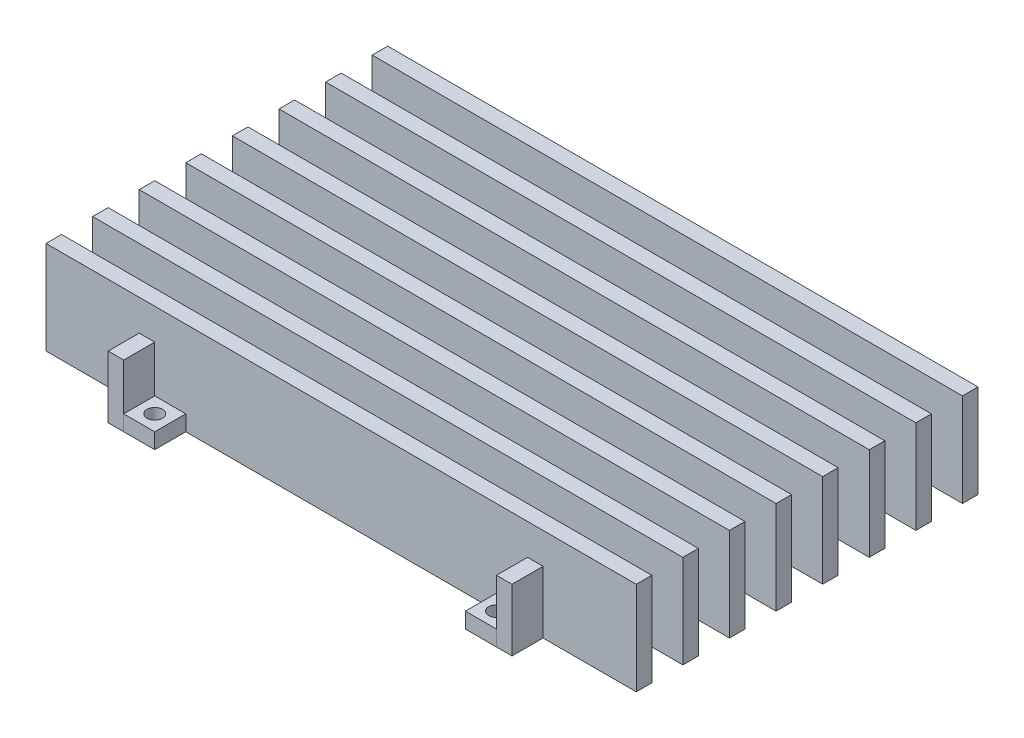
from build123d import *

# Parameters (mm, degrees)
SKETCH2_W             = 120.65
SKETCH2_H             = 3.175
BOSS_EXTRUDE1_DEPTH   = 9.525
BOSS_EXTRUDE1_2_DEPTH = 9.525
BOSS_EXTRUDE1_3_DEPTH = 9.525
BOSS_EXTRUDE1_4_DEPTH = 9.525
BOSS_EXTRUDE1_5_DEPTH = 9.525
BOSS_EXTRUDE1_6_DEPTH = 9.525
BOSS_EXTRUDE1_7_DEPTH = 9.525
BOSS_EXTRUDE1_8_DEPTH = 9.525
SKETCH3_W             = 3.175
SKETCH3_H             = 82.55
BOSS_EXTRUDE2_DEPTH   = 12.7
SKETCH4_W             = 6.35
SKETCH4_H             = 6.35
SKETCH4_R             = 1.5875
BOSS_EXTRUDE3_DEPTH   = 3.175
BOSS_EXTRUDE3_2_DEPTH = 3.175
BOSS_EXTRUDE3_3_DEPTH = 3.175
BOSS_EXTRUDE3_4_DEPTH = 3.175


with BuildPart() as part:
    # Sketch2 → Boss-Extrude1 (new, symmetric)
    with BuildSketch(Plane(origin=(0, 0, 0), x_dir=(1, 0, 0), z_dir=(0, 1, 0))):
        with Locations((0, -33.3375)):
            Rectangle(SKETCH2_W, SKETCH2_H)
    extrude(amount=BOSS_EXTRUDE1_DEPTH, both=True)



with BuildPart() as body_2:
    # Sketch2 → Boss-Extrude1 2 (new, symmetric)
    with BuildSketch(Plane(origin=(0, 0, 0), x_dir=(1, 0, 0), z_dir=(0, 1, 0))):
        with Locations((0, -23.8125)):
            Rectangle(SKETCH2_W, SKETCH2_H)
    extrude(amount=BOSS_EXTRUDE1_2_DEPTH, both=True)


with BuildPart() as body_3:
    # Sketch2 → Boss-Extrude1 3 (new, symmetric)
    with BuildSketch(Plane(origin=(0, 0, 0), x_dir=(1, 0, 0), z_dir=(0, 1, 0))):
        with Locations((0, -14.2875)):
            Rectangle(SKETCH2_W, SKETCH2_H)
    extrude(amount=BOSS_EXTRUDE1_3_DEPTH, both=True)


with BuildPart() as body_4:
    # Sketch2 → Boss-Extrude1 4 (new, symmetric)
    with BuildSketch(Plane(origin=(0, 0, 0), x_dir=(1, 0, 0), z_dir=(0, 1, 0))):
        with Locations((0, -4.7625)):
            Rectangle(SKETCH2_W, SKETCH2_H)
    extrude(amount=BOSS_EXTRUDE1_4_DEPTH, both=True)


with BuildPart() as body_5:
    # Sketch2 → Boss-Extrude1 5 (new, symmetric)
    with BuildSketch(Plane(origin=(0, 0, 0), x_dir=(1, 0, 0), z_dir=(0, 1, 0))):
        with Locations((0, 4.7625)):
            Rectangle(SKETCH2_W, SKETCH2_H)
    extrude(amount=BOSS_EXTRUDE1_5_DEPTH, both=True)


with BuildPart() as body_6:
    # Sketch2 → Boss-Extrude1 6 (new, symmetric)
    with BuildSketch(Plane(origin=(0, 0, 0), x_dir=(1, 0, 0), z_dir=(0, 1, 0))):
        with Locations((0, 14.2875)):
            Rectangle(SKETCH2_W, SKETCH2_H)
    extrude(amount=BOSS_EXTRUDE1_6_DEPTH, both=True)


with BuildPart() as body_7:
    # Sketch2 → Boss-Extrude1 7 (new, symmetric)
    with BuildSketch(Plane(origin=(0, 0, 0), x_dir=(1, 0, 0), z_dir=(0, 1, 0))):
        with Locations((0, 23.8125)):
            Rectangle(SKETCH2_W, SKETCH2_H)
    extrude(amount=BOSS_EXTRUDE1_7_DEPTH, both=True)


with BuildPart() as body_8:
    # Sketch2 → Boss-Extrude1 8 (new, symmetric)
    with BuildSketch(Plane(origin=(0, 0, 0), x_dir=(1, 0, 0), z_dir=(0, 1, 0))):
        with Locations((0, 33.3375)):
            Rectangle(SKETCH2_W, SKETCH2_H)
    extrude(amount=BOSS_EXTRUDE1_8_DEPTH, both=True)


with BuildPart() as part_1:
    add(part.part)

    add(body_2.part)  # Boss-Extrude2 merges body 2

    add(body_3.part)  # Boss-Extrude2 merges body 3

    add(body_4.part)  # Boss-Extrude2 merges body 4

    add(body_5.part)  # Boss-Extrude2 merges body 5

    add(body_6.part)  # Boss-Extrude2 merges body 6

    add(body_7.part)  # Boss-Extrude2 merges body 7

    add(body_8.part)  # Boss-Extrude2 merges body 8
    # Sketch3 → Boss-Extrude2 (add)
    with BuildSketch(Plane.XZ.offset(9.525)):
        with Locations((-39.6875, 0)):
            Rectangle(SKETCH3_W, SKETCH3_H)
        with Locations((39.6875, 0)):
            Rectangle(SKETCH3_W, SKETCH3_H)
    extrude(amount=-BOSS_EXTRUDE2_DEPTH)


with BuildPart() as body_2_2:
    # Sketch4 → Boss-Extrude3 (new body)
    with BuildSketch(Plane.XZ.offset(9.525)):
        with Locations((34.925, -38.1)):
            Rectangle(SKETCH4_W, SKETCH4_H)
        with Locations(Location((34.925, -38.1, 0), (0, 0, 270))):
            Circle(SKETCH4_R, mode=Mode.SUBTRACT)
    extrude(amount=-BOSS_EXTRUDE3_DEPTH)


with BuildPart() as body_3_2:
    # Sketch4 → Boss-Extrude3 2 (new body)
    with BuildSketch(Plane.XZ.offset(9.525)):
        with Locations((-34.925, -38.1)):
            Rectangle(SKETCH4_W, SKETCH4_H)
        with Locations(Location((-34.925, -38.1, 0), (0, 0, 90))):
            Circle(SKETCH4_R, mode=Mode.SUBTRACT)
    extrude(amount=-BOSS_EXTRUDE3_2_DEPTH)


with BuildPart() as body_4_2:
    # Sketch4 → Boss-Extrude3 3 (new body)
    with BuildSketch(Plane.XZ.offset(9.525)):
        with Locations((-34.925, 38.1)):
            Rectangle(SKETCH4_W, SKETCH4_H)
        with Locations(Location((-34.925, 38.1, 0), (0, 0, 270))):
            Circle(SKETCH4_R, mode=Mode.SUBTRACT)
    extrude(amount=-BOSS_EXTRUDE3_3_DEPTH)


with BuildPart() as body_5_2:
    # Sketch4 → Boss-Extrude3 4 (new body)
    with BuildSketch(Plane.XZ.offset(9.525)):
        with Locations((34.925, 38.1)):
            Rectangle(SKETCH4_W, SKETCH4_H)
        with Locations(Location((34.925, 38.1, 0), (0, 0, 90))):
            Circle(SKETCH4_R, mode=Mode.SUBTRACT)
    extrude(amount=-BOSS_EXTRUDE3_4_DEPTH)


solid = Compound([part_1.part, body_2_2.part, body_3_2.part, body_4_2.part, body_5_2.part])
